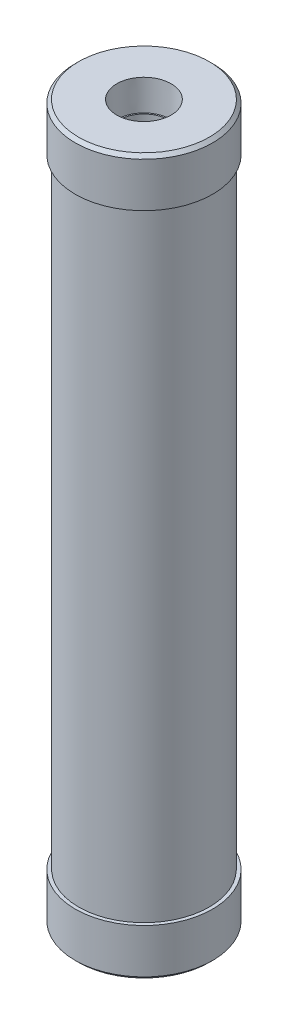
from build123d import *

# Parameters (mm, degrees)
SKETCH1_R           = 30.1625
SKETCH1_R_2         = 25.9969
BOSS_EXTRUDE1_DEPTH = 330.2
SKETCH2_R           = 31.75
BOSS_EXTRUDE2_DEPTH = 22.098
BOSS_EXTRUDE3_START = 22.098
SKETCH5_R           = 31.75
BOSS_EXTRUDE3_DEPTH = 22.098
CHAMFER1_SIZE       = 1.524


with BuildPart() as part:
    # Sketch1 → Boss-Extrude1 (new body)
    with BuildSketch(Plane(origin=(0, 0, 0), x_dir=(1, 0, 0), z_dir=(0, 1, 0))):
        with Locations(Location((0, 0, 0), (0, 0, 270))):
            Circle(SKETCH1_R)
        with Locations(Location((0, 0, 0), (0, 0, 270))):
            Circle(SKETCH1_R_2, mode=Mode.SUBTRACT)
    extrude(amount=BOSS_EXTRUDE1_DEPTH)

    # Sketch2 → Boss-Extrude2 (add)
    with BuildSketch(Plane(origin=(0, 330.2, 0), x_dir=(1, 0, 0), z_dir=(0, 1, 0))):
        with Locations(Location((0, 0, 0), (0, 0, 270))):
            Circle(SKETCH2_R)
    extrude(amount=-BOSS_EXTRUDE2_DEPTH)

    # Sketch3 → 3_4 NPT Tapped Hole1 (revolve, cut)
    with BuildSketch(Plane(origin=(0, 330.2, 0), x_dir=(0, 0, 1), z_dir=(1, 0, 0))):
        Polygon((0, 0), (0, 30.027622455), (11.5062, 23.114), (11.5062, 13.97), (12.137853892, 13.97), (12.5561344, 0), align=None)
    revolve(axis=Axis((0, 336.55, 0), (0, -1, 0)), mode=Mode.SUBTRACT)

    # Sketch5 → Boss-Extrude3 (add)
    with BuildSketch(Plane(origin=(0, 0, 0), x_dir=(1, 0, 0), z_dir=(0, 1, 0)).offset(BOSS_EXTRUDE3_START)):
        with Locations(Location((0, 0, 0), (0, 0, 270))):
            Circle(SKETCH5_R)
    extrude(amount=-BOSS_EXTRUDE3_DEPTH)

    # Sketch6 → 3_4 NPT Tapped Hole2 (revolve, cut)
    with BuildSketch(Plane(origin=(0, 0, 0), x_dir=(0, 0, -1), z_dir=(1, 0, 0))):
        Polygon((0, 0), (0, 30.027622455), (11.5062, 23.114), (11.5062, 13.97), (12.137853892, 13.97), (12.5561344, 0), align=None)
    revolve(axis=Axis((0, -6.35, 0), (0, 1, 0)), mode=Mode.SUBTRACT)

    # Chamfer1
    chamfer1_edges = [part.edges().sort_by_distance(p)[0] for p in [
        (0, 330.2, -31.75),
        (0, 0, -31.75),
    ]]
    chamfer(chamfer1_edges, length=CHAMFER1_SIZE)


solid = part.part
